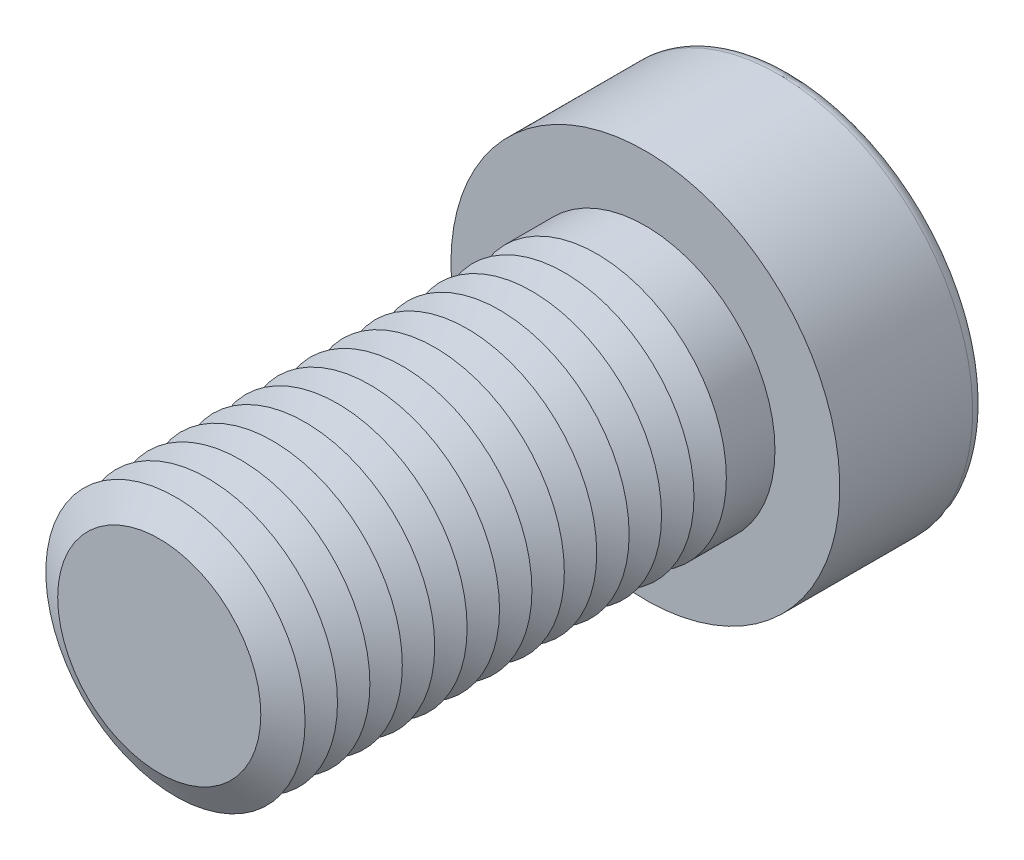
ISO-10303-21;
HEADER;
FILE_DESCRIPTION(('STEP AP214'),'2;1');
FILE_NAME('part.step','',(''),(''),'','','');
FILE_SCHEMA(('AUTOMOTIVE_DESIGN { 1 0 10303 214 1 1 1 1 }'));
ENDSEC;
DATA;
#1=APPLICATION_CONTEXT('core data for automotive mechanical design processes');
#2=APPLICATION_PROTOCOL_DEFINITION('international standard','automotive_design',2000,#1);
#3=PRODUCT_CONTEXT('',#1,'mechanical');
#4=PRODUCT('Part','Part','',(#3));
#5=PRODUCT_RELATED_PRODUCT_CATEGORY('part','',(#4));
#6=PRODUCT_DEFINITION_FORMATION('','',#4);
#7=PRODUCT_DEFINITION_CONTEXT('part definition',#1,'design');
#8=PRODUCT_DEFINITION('design','',#6,#7);
#9=PRODUCT_DEFINITION_SHAPE('','',#8);
#10=(LENGTH_UNIT() NAMED_UNIT(*) SI_UNIT(.MILLI.,.METRE.));
#11=(NAMED_UNIT(*) PLANE_ANGLE_UNIT() SI_UNIT($,.RADIAN.));
#12=(NAMED_UNIT(*) SI_UNIT($,.STERADIAN.) SOLID_ANGLE_UNIT());
#13=UNCERTAINTY_MEASURE_WITH_UNIT(LENGTH_MEASURE(1.E-05),#10,'distance_accuracy_value','');
#14=(GEOMETRIC_REPRESENTATION_CONTEXT(3) GLOBAL_UNCERTAINTY_ASSIGNED_CONTEXT((#13)) GLOBAL_UNIT_ASSIGNED_CONTEXT((#10,
#11,#12)) REPRESENTATION_CONTEXT('',''));
#15=CARTESIAN_POINT('',(0.,0.,0.));
#16=DIRECTION('',(0.,0.,1.));
#17=DIRECTION('',(1.,0.,0.));
#18=AXIS2_PLACEMENT_3D('',#15,#16,#17);
#19=CARTESIAN_POINT('',(0.,0.,23.));
#20=DIRECTION('',(0.,0.,1.));
#21=DIRECTION('',(1.,0.,0.));
#22=AXIS2_PLACEMENT_3D('',#19,#20,#21);
#23=CONICAL_SURFACE('',#22,8.,1.0471975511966);
#24=CARTESIAN_POINT('',(0.,0.,22.));
#25=DIRECTION('',(0.,0.,1.));
#26=DIRECTION('',(1.,0.,0.));
#27=AXIS2_PLACEMENT_3D('',#24,#25,#26);
#28=CIRCLE('',#27,6.26794919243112);
#29=CARTESIAN_POINT('',(6.26794919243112,0.,22.));
#30=VERTEX_POINT('',#29);
#31=EDGE_CURVE('E314',#30,#30,#28,.T.);
#32=ORIENTED_EDGE('',*,*,#31,.T.);
#33=EDGE_LOOP('',(#32));
#34=FACE_BOUND('',#33,.T.);
#35=CARTESIAN_POINT('',(0.,0.,23.));
#36=DIRECTION('',(0.,0.,1.));
#37=DIRECTION('',(1.,0.,0.));
#38=AXIS2_PLACEMENT_3D('',#35,#36,#37);
#39=CIRCLE('',#38,8.);
#40=CARTESIAN_POINT('',(8.,0.,23.));
#41=VERTEX_POINT('',#40);
#42=EDGE_CURVE('E317',#41,#41,#39,.T.);
#43=ORIENTED_EDGE('',*,*,#42,.F.);
#44=EDGE_LOOP('',(#43));
#45=FACE_BOUND('',#44,.T.);
#46=ADVANCED_FACE('F39',(#34,#45),#23,.T.);
#47=CARTESIAN_POINT('',(0.,0.,22.));
#48=DIRECTION('',(0.,0.,-1.));
#49=DIRECTION('',(-1.,0.,0.));
#50=AXIS2_PLACEMENT_3D('',#47,#48,#49);
#51=CONICAL_SURFACE('',#50,6.26794919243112,1.0471975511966);
#52=CARTESIAN_POINT('',(0.,0.,21.));
#53=DIRECTION('',(0.,0.,1.));
#54=DIRECTION('',(1.,0.,0.));
#55=AXIS2_PLACEMENT_3D('',#52,#53,#54);
#56=CIRCLE('',#55,8.);
#57=CARTESIAN_POINT('',(8.,0.,21.));
#58=VERTEX_POINT('',#57);
#59=EDGE_CURVE('E324',#58,#58,#56,.T.);
#60=ORIENTED_EDGE('',*,*,#59,.T.);
#61=EDGE_LOOP('',(#60));
#62=FACE_BOUND('',#61,.T.);
#63=ORIENTED_EDGE('',*,*,#31,.F.);
#64=EDGE_LOOP('',(#63));
#65=FACE_BOUND('',#64,.T.);
#66=ADVANCED_FACE('F245',(#62,#65),#51,.T.);
#67=CARTESIAN_POINT('',(0.,0.,30.));
#68=DIRECTION('',(0.,0.,1.));
#69=DIRECTION('',(1.,0.,0.));
#70=AXIS2_PLACEMENT_3D('',#67,#68,#69);
#71=PLANE('',#70);
#72=CARTESIAN_POINT('',(0.,0.,30.));
#73=DIRECTION('',(0.,0.,1.));
#74=DIRECTION('',(1.,0.,0.));
#75=AXIS2_PLACEMENT_3D('',#72,#73,#74);
#76=CIRCLE('',#75,6.26794919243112);
#77=CARTESIAN_POINT('',(6.26794919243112,0.,30.));
#78=VERTEX_POINT('',#77);
#79=EDGE_CURVE('E174',#78,#78,#76,.T.);
#80=ORIENTED_EDGE('',*,*,#79,.T.);
#81=EDGE_LOOP('',(#80));
#82=FACE_BOUND('',#81,.T.);
#83=ADVANCED_FACE('F251',(#82),#71,.T.);
#84=CARTESIAN_POINT('',(0.,0.,30.));
#85=DIRECTION('',(0.,0.,-1.));
#86=DIRECTION('',(-1.,0.,0.));
#87=AXIS2_PLACEMENT_3D('',#84,#85,#86);
#88=CONICAL_SURFACE('',#87,6.26794919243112,1.0471975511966);
#89=CARTESIAN_POINT('',(0.,0.,29.));
#90=DIRECTION('',(0.,0.,1.));
#91=DIRECTION('',(1.,0.,0.));
#92=AXIS2_PLACEMENT_3D('',#89,#90,#91);
#93=CIRCLE('',#92,8.);
#94=CARTESIAN_POINT('',(8.,0.,29.));
#95=VERTEX_POINT('',#94);
#96=EDGE_CURVE('E291',#95,#95,#93,.T.);
#97=ORIENTED_EDGE('',*,*,#96,.T.);
#98=EDGE_LOOP('',(#97));
#99=FACE_BOUND('',#98,.T.);
#100=ORIENTED_EDGE('',*,*,#79,.F.);
#101=EDGE_LOOP('',(#100));
#102=FACE_BOUND('',#101,.T.);
#103=ADVANCED_FACE('F199',(#99,#102),#88,.T.);
#104=CARTESIAN_POINT('',(0.,0.,29.));
#105=DIRECTION('',(0.,0.,1.));
#106=DIRECTION('',(1.,0.,0.));
#107=AXIS2_PLACEMENT_3D('',#104,#105,#106);
#108=CONICAL_SURFACE('',#107,8.,1.0471975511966);
#109=CARTESIAN_POINT('',(0.,0.,28.));
#110=DIRECTION('',(0.,0.,1.));
#111=DIRECTION('',(1.,0.,0.));
#112=AXIS2_PLACEMENT_3D('',#109,#110,#111);
#113=CIRCLE('',#112,6.26794919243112);
#114=CARTESIAN_POINT('',(6.26794919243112,0.,28.));
#115=VERTEX_POINT('',#114);
#116=EDGE_CURVE('E288',#115,#115,#113,.T.);
#117=ORIENTED_EDGE('',*,*,#116,.T.);
#118=EDGE_LOOP('',(#117));
#119=FACE_BOUND('',#118,.T.);
#120=ORIENTED_EDGE('',*,*,#96,.F.);
#121=EDGE_LOOP('',(#120));
#122=FACE_BOUND('',#121,.T.);
#123=ADVANCED_FACE('F277',(#119,#122),#108,.T.);
#124=CARTESIAN_POINT('',(0.,0.,28.));
#125=DIRECTION('',(0.,0.,-1.));
#126=DIRECTION('',(-1.,0.,0.));
#127=AXIS2_PLACEMENT_3D('',#124,#125,#126);
#128=CONICAL_SURFACE('',#127,6.26794919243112,1.0471975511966);
#129=CARTESIAN_POINT('',(0.,0.,27.));
#130=DIRECTION('',(0.,0.,1.));
#131=DIRECTION('',(1.,0.,0.));
#132=AXIS2_PLACEMENT_3D('',#129,#130,#131);
#133=CIRCLE('',#132,8.);
#134=CARTESIAN_POINT('',(8.,0.,27.));
#135=VERTEX_POINT('',#134);
#136=EDGE_CURVE('E300',#135,#135,#133,.T.);
#137=ORIENTED_EDGE('',*,*,#136,.T.);
#138=EDGE_LOOP('',(#137));
#139=FACE_BOUND('',#138,.T.);
#140=ORIENTED_EDGE('',*,*,#116,.F.);
#141=EDGE_LOOP('',(#140));
#142=FACE_BOUND('',#141,.T.);
#143=ADVANCED_FACE('F274',(#139,#142),#128,.T.);
#144=CARTESIAN_POINT('',(0.,0.,27.));
#145=DIRECTION('',(0.,0.,1.));
#146=DIRECTION('',(1.,0.,0.));
#147=AXIS2_PLACEMENT_3D('',#144,#145,#146);
#148=CONICAL_SURFACE('',#147,8.,1.0471975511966);
#149=CARTESIAN_POINT('',(0.,0.,26.));
#150=DIRECTION('',(0.,0.,1.));
#151=DIRECTION('',(1.,0.,0.));
#152=AXIS2_PLACEMENT_3D('',#149,#150,#151);
#153=CIRCLE('',#152,6.26794919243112);
#154=CARTESIAN_POINT('',(6.26794919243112,0.,26.));
#155=VERTEX_POINT('',#154);
#156=EDGE_CURVE('E293',#155,#155,#153,.T.);
#157=ORIENTED_EDGE('',*,*,#156,.T.);
#158=EDGE_LOOP('',(#157));
#159=FACE_BOUND('',#158,.T.);
#160=ORIENTED_EDGE('',*,*,#136,.F.);
#161=EDGE_LOOP('',(#160));
#162=FACE_BOUND('',#161,.T.);
#163=ADVANCED_FACE('F270',(#159,#162),#148,.T.);
#164=CARTESIAN_POINT('',(0.,0.,26.));
#165=DIRECTION('',(0.,0.,-1.));
#166=DIRECTION('',(-1.,0.,0.));
#167=AXIS2_PLACEMENT_3D('',#164,#165,#166);
#168=CONICAL_SURFACE('',#167,6.26794919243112,1.0471975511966);
#169=CARTESIAN_POINT('',(0.,0.,25.));
#170=DIRECTION('',(0.,0.,1.));
#171=DIRECTION('',(1.,0.,0.));
#172=AXIS2_PLACEMENT_3D('',#169,#170,#171);
#173=CIRCLE('',#172,8.);
#174=CARTESIAN_POINT('',(8.,0.,25.));
#175=VERTEX_POINT('',#174);
#176=EDGE_CURVE('E310',#175,#175,#173,.T.);
#177=ORIENTED_EDGE('',*,*,#176,.T.);
#178=EDGE_LOOP('',(#177));
#179=FACE_BOUND('',#178,.T.);
#180=ORIENTED_EDGE('',*,*,#156,.F.);
#181=EDGE_LOOP('',(#180));
#182=FACE_BOUND('',#181,.T.);
#183=ADVANCED_FACE('F266',(#179,#182),#168,.T.);
#184=CARTESIAN_POINT('',(0.,0.,25.));
#185=DIRECTION('',(0.,0.,1.));
#186=DIRECTION('',(1.,0.,0.));
#187=AXIS2_PLACEMENT_3D('',#184,#185,#186);
#188=CONICAL_SURFACE('',#187,8.,1.0471975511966);
#189=CARTESIAN_POINT('',(0.,0.,24.));
#190=DIRECTION('',(0.,0.,1.));
#191=DIRECTION('',(1.,0.,0.));
#192=AXIS2_PLACEMENT_3D('',#189,#190,#191);
#193=CIRCLE('',#192,6.26794919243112);
#194=CARTESIAN_POINT('',(6.26794919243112,0.,24.));
#195=VERTEX_POINT('',#194);
#196=EDGE_CURVE('E306',#195,#195,#193,.T.);
#197=ORIENTED_EDGE('',*,*,#196,.T.);
#198=EDGE_LOOP('',(#197));
#199=FACE_BOUND('',#198,.T.);
#200=ORIENTED_EDGE('',*,*,#176,.F.);
#201=EDGE_LOOP('',(#200));
#202=FACE_BOUND('',#201,.T.);
#203=ADVANCED_FACE('F262',(#199,#202),#188,.T.);
#204=CARTESIAN_POINT('',(0.,0.,24.));
#205=DIRECTION('',(0.,0.,-1.));
#206=DIRECTION('',(-1.,0.,0.));
#207=AXIS2_PLACEMENT_3D('',#204,#205,#206);
#208=CONICAL_SURFACE('',#207,6.26794919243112,1.0471975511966);
#209=ORIENTED_EDGE('',*,*,#42,.T.);
#210=EDGE_LOOP('',(#209));
#211=FACE_BOUND('',#210,.T.);
#212=ORIENTED_EDGE('',*,*,#196,.F.);
#213=EDGE_LOOP('',(#212));
#214=FACE_BOUND('',#213,.T.);
#215=ADVANCED_FACE('F258',(#211,#214),#208,.T.);
#216=CARTESIAN_POINT('',(0.,0.,21.));
#217=DIRECTION('',(0.,0.,1.));
#218=DIRECTION('',(1.,0.,0.));
#219=AXIS2_PLACEMENT_3D('',#216,#217,#218);
#220=CONICAL_SURFACE('',#219,8.,1.0471975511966);
#221=CARTESIAN_POINT('',(0.,0.,20.));
#222=DIRECTION('',(0.,0.,1.));
#223=DIRECTION('',(1.,0.,0.));
#224=AXIS2_PLACEMENT_3D('',#221,#222,#223);
#225=CIRCLE('',#224,6.26794919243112);
#226=CARTESIAN_POINT('',(6.26794919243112,0.,20.));
#227=VERTEX_POINT('',#226);
#228=EDGE_CURVE('E320',#227,#227,#225,.T.);
#229=ORIENTED_EDGE('',*,*,#228,.T.);
#230=EDGE_LOOP('',(#229));
#231=FACE_BOUND('',#230,.T.);
#232=ORIENTED_EDGE('',*,*,#59,.F.);
#233=EDGE_LOOP('',(#232));
#234=FACE_BOUND('',#233,.T.);
#235=ADVANCED_FACE('F261',(#231,#234),#220,.T.);
#236=CARTESIAN_POINT('',(0.,0.,20.));
#237=DIRECTION('',(0.,0.,-1.));
#238=DIRECTION('',(-1.,0.,0.));
#239=AXIS2_PLACEMENT_3D('',#236,#237,#238);
#240=CONICAL_SURFACE('',#239,6.26794919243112,1.0471975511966);
#241=CARTESIAN_POINT('',(0.,0.,19.));
#242=DIRECTION('',(0.,0.,1.));
#243=DIRECTION('',(1.,0.,0.));
#244=AXIS2_PLACEMENT_3D('',#241,#242,#243);
#245=CIRCLE('',#244,8.);
#246=CARTESIAN_POINT('',(8.,0.,19.));
#247=VERTEX_POINT('',#246);
#248=EDGE_CURVE('E332',#247,#247,#245,.T.);
#249=ORIENTED_EDGE('',*,*,#248,.T.);
#250=EDGE_LOOP('',(#249));
#251=FACE_BOUND('',#250,.T.);
#252=ORIENTED_EDGE('',*,*,#228,.F.);
#253=EDGE_LOOP('',(#252));
#254=FACE_BOUND('',#253,.T.);
#255=ADVANCED_FACE('F464',(#251,#254),#240,.T.);
#256=CARTESIAN_POINT('',(0.,0.,19.));
#257=DIRECTION('',(0.,0.,1.));
#258=DIRECTION('',(1.,0.,0.));
#259=AXIS2_PLACEMENT_3D('',#256,#257,#258);
#260=CONICAL_SURFACE('',#259,8.,1.0471975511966);
#261=CARTESIAN_POINT('',(0.,0.,18.));
#262=DIRECTION('',(0.,0.,1.));
#263=DIRECTION('',(1.,0.,0.));
#264=AXIS2_PLACEMENT_3D('',#261,#262,#263);
#265=CIRCLE('',#264,6.26794919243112);
#266=CARTESIAN_POINT('',(6.26794919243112,0.,18.));
#267=VERTEX_POINT('',#266);
#268=EDGE_CURVE('E328',#267,#267,#265,.T.);
#269=ORIENTED_EDGE('',*,*,#268,.T.);
#270=EDGE_LOOP('',(#269));
#271=FACE_BOUND('',#270,.T.);
#272=ORIENTED_EDGE('',*,*,#248,.F.);
#273=EDGE_LOOP('',(#272));
#274=FACE_BOUND('',#273,.T.);
#275=ADVANCED_FACE('F460',(#271,#274),#260,.T.);
#276=CARTESIAN_POINT('',(0.,0.,18.));
#277=DIRECTION('',(0.,0.,-1.));
#278=DIRECTION('',(-1.,0.,0.));
#279=AXIS2_PLACEMENT_3D('',#276,#277,#278);
#280=CONICAL_SURFACE('',#279,6.26794919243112,1.0471975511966);
#281=CARTESIAN_POINT('',(0.,0.,17.));
#282=DIRECTION('',(0.,0.,1.));
#283=DIRECTION('',(1.,0.,0.));
#284=AXIS2_PLACEMENT_3D('',#281,#282,#283);
#285=CIRCLE('',#284,8.);
#286=CARTESIAN_POINT('',(8.,0.,17.));
#287=VERTEX_POINT('',#286);
#288=EDGE_CURVE('E340',#287,#287,#285,.T.);
#289=ORIENTED_EDGE('',*,*,#288,.T.);
#290=EDGE_LOOP('',(#289));
#291=FACE_BOUND('',#290,.T.);
#292=ORIENTED_EDGE('',*,*,#268,.F.);
#293=EDGE_LOOP('',(#292));
#294=FACE_BOUND('',#293,.T.);
#295=ADVANCED_FACE('F456',(#291,#294),#280,.T.);
#296=CARTESIAN_POINT('',(0.,0.,17.));
#297=DIRECTION('',(0.,0.,1.));
#298=DIRECTION('',(1.,0.,0.));
#299=AXIS2_PLACEMENT_3D('',#296,#297,#298);
#300=CONICAL_SURFACE('',#299,8.,1.0471975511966);
#301=CARTESIAN_POINT('',(0.,0.,16.));
#302=DIRECTION('',(0.,0.,1.));
#303=DIRECTION('',(1.,0.,0.));
#304=AXIS2_PLACEMENT_3D('',#301,#302,#303);
#305=CIRCLE('',#304,6.26794919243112);
#306=CARTESIAN_POINT('',(6.26794919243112,0.,16.));
#307=VERTEX_POINT('',#306);
#308=EDGE_CURVE('E336',#307,#307,#305,.T.);
#309=ORIENTED_EDGE('',*,*,#308,.T.);
#310=EDGE_LOOP('',(#309));
#311=FACE_BOUND('',#310,.T.);
#312=ORIENTED_EDGE('',*,*,#288,.F.);
#313=EDGE_LOOP('',(#312));
#314=FACE_BOUND('',#313,.T.);
#315=ADVANCED_FACE('F452',(#311,#314),#300,.T.);
#316=CARTESIAN_POINT('',(0.,0.,16.));
#317=DIRECTION('',(0.,0.,-1.));
#318=DIRECTION('',(-1.,0.,0.));
#319=AXIS2_PLACEMENT_3D('',#316,#317,#318);
#320=CONICAL_SURFACE('',#319,6.26794919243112,1.0471975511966);
#321=CARTESIAN_POINT('',(0.,0.,15.));
#322=DIRECTION('',(0.,0.,1.));
#323=DIRECTION('',(1.,0.,0.));
#324=AXIS2_PLACEMENT_3D('',#321,#322,#323);
#325=CIRCLE('',#324,8.);
#326=CARTESIAN_POINT('',(8.,0.,15.));
#327=VERTEX_POINT('',#326);
#328=EDGE_CURVE('E348',#327,#327,#325,.T.);
#329=ORIENTED_EDGE('',*,*,#328,.T.);
#330=EDGE_LOOP('',(#329));
#331=FACE_BOUND('',#330,.T.);
#332=ORIENTED_EDGE('',*,*,#308,.F.);
#333=EDGE_LOOP('',(#332));
#334=FACE_BOUND('',#333,.T.);
#335=ADVANCED_FACE('F448',(#331,#334),#320,.T.);
#336=CARTESIAN_POINT('',(0.,0.,15.));
#337=DIRECTION('',(0.,0.,1.));
#338=DIRECTION('',(1.,0.,0.));
#339=AXIS2_PLACEMENT_3D('',#336,#337,#338);
#340=CONICAL_SURFACE('',#339,8.,1.0471975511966);
#341=CARTESIAN_POINT('',(0.,0.,14.));
#342=DIRECTION('',(0.,0.,1.));
#343=DIRECTION('',(1.,0.,0.));
#344=AXIS2_PLACEMENT_3D('',#341,#342,#343);
#345=CIRCLE('',#344,6.26794919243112);
#346=CARTESIAN_POINT('',(6.26794919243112,0.,14.));
#347=VERTEX_POINT('',#346);
#348=EDGE_CURVE('E344',#347,#347,#345,.T.);
#349=ORIENTED_EDGE('',*,*,#348,.T.);
#350=EDGE_LOOP('',(#349));
#351=FACE_BOUND('',#350,.T.);
#352=ORIENTED_EDGE('',*,*,#328,.F.);
#353=EDGE_LOOP('',(#352));
#354=FACE_BOUND('',#353,.T.);
#355=ADVANCED_FACE('F444',(#351,#354),#340,.T.);
#356=CARTESIAN_POINT('',(0.,0.,14.));
#357=DIRECTION('',(0.,0.,-1.));
#358=DIRECTION('',(-1.,0.,0.));
#359=AXIS2_PLACEMENT_3D('',#356,#357,#358);
#360=CONICAL_SURFACE('',#359,6.26794919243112,1.0471975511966);
#361=CARTESIAN_POINT('',(0.,0.,13.));
#362=DIRECTION('',(0.,0.,1.));
#363=DIRECTION('',(1.,0.,0.));
#364=AXIS2_PLACEMENT_3D('',#361,#362,#363);
#365=CIRCLE('',#364,8.);
#366=CARTESIAN_POINT('',(8.,0.,13.));
#367=VERTEX_POINT('',#366);
#368=EDGE_CURVE('E356',#367,#367,#365,.T.);
#369=ORIENTED_EDGE('',*,*,#368,.T.);
#370=EDGE_LOOP('',(#369));
#371=FACE_BOUND('',#370,.T.);
#372=ORIENTED_EDGE('',*,*,#348,.F.);
#373=EDGE_LOOP('',(#372));
#374=FACE_BOUND('',#373,.T.);
#375=ADVANCED_FACE('F440',(#371,#374),#360,.T.);
#376=CARTESIAN_POINT('',(0.,0.,13.));
#377=DIRECTION('',(0.,0.,1.));
#378=DIRECTION('',(1.,0.,0.));
#379=AXIS2_PLACEMENT_3D('',#376,#377,#378);
#380=CONICAL_SURFACE('',#379,8.,1.0471975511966);
#381=CARTESIAN_POINT('',(0.,0.,12.));
#382=DIRECTION('',(0.,0.,1.));
#383=DIRECTION('',(1.,0.,0.));
#384=AXIS2_PLACEMENT_3D('',#381,#382,#383);
#385=CIRCLE('',#384,6.26794919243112);
#386=CARTESIAN_POINT('',(6.26794919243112,0.,12.));
#387=VERTEX_POINT('',#386);
#388=EDGE_CURVE('E352',#387,#387,#385,.T.);
#389=ORIENTED_EDGE('',*,*,#388,.T.);
#390=EDGE_LOOP('',(#389));
#391=FACE_BOUND('',#390,.T.);
#392=ORIENTED_EDGE('',*,*,#368,.F.);
#393=EDGE_LOOP('',(#392));
#394=FACE_BOUND('',#393,.T.);
#395=ADVANCED_FACE('F436',(#391,#394),#380,.T.);
#396=CARTESIAN_POINT('',(0.,0.,12.));
#397=DIRECTION('',(0.,0.,-1.));
#398=DIRECTION('',(-1.,0.,0.));
#399=AXIS2_PLACEMENT_3D('',#396,#397,#398);
#400=CONICAL_SURFACE('',#399,6.26794919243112,1.0471975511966);
#401=CARTESIAN_POINT('',(0.,0.,11.));
#402=DIRECTION('',(0.,0.,1.));
#403=DIRECTION('',(1.,0.,0.));
#404=AXIS2_PLACEMENT_3D('',#401,#402,#403);
#405=CIRCLE('',#404,8.);
#406=CARTESIAN_POINT('',(8.,0.,11.));
#407=VERTEX_POINT('',#406);
#408=EDGE_CURVE('E364',#407,#407,#405,.T.);
#409=ORIENTED_EDGE('',*,*,#408,.T.);
#410=EDGE_LOOP('',(#409));
#411=FACE_BOUND('',#410,.T.);
#412=ORIENTED_EDGE('',*,*,#388,.F.);
#413=EDGE_LOOP('',(#412));
#414=FACE_BOUND('',#413,.T.);
#415=ADVANCED_FACE('F432',(#411,#414),#400,.T.);
#416=CARTESIAN_POINT('',(0.,0.,11.));
#417=DIRECTION('',(0.,0.,1.));
#418=DIRECTION('',(1.,0.,0.));
#419=AXIS2_PLACEMENT_3D('',#416,#417,#418);
#420=CONICAL_SURFACE('',#419,8.,1.0471975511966);
#421=CARTESIAN_POINT('',(0.,0.,10.));
#422=DIRECTION('',(0.,0.,1.));
#423=DIRECTION('',(1.,0.,0.));
#424=AXIS2_PLACEMENT_3D('',#421,#422,#423);
#425=CIRCLE('',#424,6.26794919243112);
#426=CARTESIAN_POINT('',(6.26794919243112,0.,10.));
#427=VERTEX_POINT('',#426);
#428=EDGE_CURVE('E360',#427,#427,#425,.T.);
#429=ORIENTED_EDGE('',*,*,#428,.T.);
#430=EDGE_LOOP('',(#429));
#431=FACE_BOUND('',#430,.T.);
#432=ORIENTED_EDGE('',*,*,#408,.F.);
#433=EDGE_LOOP('',(#432));
#434=FACE_BOUND('',#433,.T.);
#435=ADVANCED_FACE('F428',(#431,#434),#420,.T.);
#436=CARTESIAN_POINT('',(0.,0.,10.));
#437=DIRECTION('',(0.,0.,-1.));
#438=DIRECTION('',(-1.,0.,0.));
#439=AXIS2_PLACEMENT_3D('',#436,#437,#438);
#440=CONICAL_SURFACE('',#439,6.26794919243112,1.0471975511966);
#441=CARTESIAN_POINT('',(0.,0.,9.));
#442=DIRECTION('',(0.,0.,1.));
#443=DIRECTION('',(1.,0.,0.));
#444=AXIS2_PLACEMENT_3D('',#441,#442,#443);
#445=CIRCLE('',#444,8.);
#446=CARTESIAN_POINT('',(8.,0.,9.));
#447=VERTEX_POINT('',#446);
#448=EDGE_CURVE('E372',#447,#447,#445,.T.);
#449=ORIENTED_EDGE('',*,*,#448,.T.);
#450=EDGE_LOOP('',(#449));
#451=FACE_BOUND('',#450,.T.);
#452=ORIENTED_EDGE('',*,*,#428,.F.);
#453=EDGE_LOOP('',(#452));
#454=FACE_BOUND('',#453,.T.);
#455=ADVANCED_FACE('F424',(#451,#454),#440,.T.);
#456=CARTESIAN_POINT('',(0.,0.,9.));
#457=DIRECTION('',(0.,0.,1.));
#458=DIRECTION('',(1.,0.,0.));
#459=AXIS2_PLACEMENT_3D('',#456,#457,#458);
#460=CONICAL_SURFACE('',#459,8.,1.0471975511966);
#461=CARTESIAN_POINT('',(0.,0.,8.));
#462=DIRECTION('',(0.,0.,1.));
#463=DIRECTION('',(1.,0.,0.));
#464=AXIS2_PLACEMENT_3D('',#461,#462,#463);
#465=CIRCLE('',#464,6.26794919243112);
#466=CARTESIAN_POINT('',(6.26794919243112,0.,8.));
#467=VERTEX_POINT('',#466);
#468=EDGE_CURVE('E368',#467,#467,#465,.T.);
#469=ORIENTED_EDGE('',*,*,#468,.T.);
#470=EDGE_LOOP('',(#469));
#471=FACE_BOUND('',#470,.T.);
#472=ORIENTED_EDGE('',*,*,#448,.F.);
#473=EDGE_LOOP('',(#472));
#474=FACE_BOUND('',#473,.T.);
#475=ADVANCED_FACE('F420',(#471,#474),#460,.T.);
#476=CARTESIAN_POINT('',(0.,0.,8.));
#477=DIRECTION('',(0.,0.,-1.));
#478=DIRECTION('',(-1.,0.,0.));
#479=AXIS2_PLACEMENT_3D('',#476,#477,#478);
#480=CONICAL_SURFACE('',#479,6.26794919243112,1.0471975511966);
#481=CARTESIAN_POINT('',(0.,0.,7.));
#482=DIRECTION('',(0.,0.,1.));
#483=DIRECTION('',(1.,0.,0.));
#484=AXIS2_PLACEMENT_3D('',#481,#482,#483);
#485=CIRCLE('',#484,8.);
#486=CARTESIAN_POINT('',(8.,0.,7.));
#487=VERTEX_POINT('',#486);
#488=EDGE_CURVE('E380',#487,#487,#485,.T.);
#489=ORIENTED_EDGE('',*,*,#488,.T.);
#490=EDGE_LOOP('',(#489));
#491=FACE_BOUND('',#490,.T.);
#492=ORIENTED_EDGE('',*,*,#468,.F.);
#493=EDGE_LOOP('',(#492));
#494=FACE_BOUND('',#493,.T.);
#495=ADVANCED_FACE('F416',(#491,#494),#480,.T.);
#496=CARTESIAN_POINT('',(0.,0.,7.));
#497=DIRECTION('',(0.,0.,1.));
#498=DIRECTION('',(1.,0.,0.));
#499=AXIS2_PLACEMENT_3D('',#496,#497,#498);
#500=CONICAL_SURFACE('',#499,8.,1.0471975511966);
#501=CARTESIAN_POINT('',(0.,0.,6.));
#502=DIRECTION('',(0.,0.,1.));
#503=DIRECTION('',(1.,0.,0.));
#504=AXIS2_PLACEMENT_3D('',#501,#502,#503);
#505=CIRCLE('',#504,6.26794919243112);
#506=CARTESIAN_POINT('',(6.26794919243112,0.,6.));
#507=VERTEX_POINT('',#506);
#508=EDGE_CURVE('E376',#507,#507,#505,.T.);
#509=ORIENTED_EDGE('',*,*,#508,.T.);
#510=EDGE_LOOP('',(#509));
#511=FACE_BOUND('',#510,.T.);
#512=ORIENTED_EDGE('',*,*,#488,.F.);
#513=EDGE_LOOP('',(#512));
#514=FACE_BOUND('',#513,.T.);
#515=ADVANCED_FACE('F411',(#511,#514),#500,.T.);
#516=CARTESIAN_POINT('',(0.,0.,6.));
#517=DIRECTION('',(0.,0.,-1.));
#518=DIRECTION('',(-1.,0.,0.));
#519=AXIS2_PLACEMENT_3D('',#516,#517,#518);
#520=CONICAL_SURFACE('',#519,6.26794919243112,1.0471975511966);
#521=CARTESIAN_POINT('',(0.,0.,5.));
#522=DIRECTION('',(0.,0.,1.));
#523=DIRECTION('',(1.,0.,0.));
#524=AXIS2_PLACEMENT_3D('',#521,#522,#523);
#525=CIRCLE('',#524,8.);
#526=CARTESIAN_POINT('',(8.,0.,5.));
#527=VERTEX_POINT('',#526);
#528=EDGE_CURVE('E392',#527,#527,#525,.T.);
#529=ORIENTED_EDGE('',*,*,#528,.T.);
#530=EDGE_LOOP('',(#529));
#531=FACE_BOUND('',#530,.T.);
#532=ORIENTED_EDGE('',*,*,#508,.F.);
#533=EDGE_LOOP('',(#532));
#534=FACE_BOUND('',#533,.T.);
#535=ADVANCED_FACE('F397',(#531,#534),#520,.T.);
#536=CARTESIAN_POINT('',(0.,0.,5.));
#537=DIRECTION('',(0.,0.,1.));
#538=DIRECTION('',(1.,0.,0.));
#539=AXIS2_PLACEMENT_3D('',#536,#537,#538);
#540=CONICAL_SURFACE('',#539,8.,1.0471975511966);
#541=CARTESIAN_POINT('',(0.,0.,4.));
#542=DIRECTION('',(0.,0.,1.));
#543=DIRECTION('',(1.,0.,0.));
#544=AXIS2_PLACEMENT_3D('',#541,#542,#543);
#545=CIRCLE('',#544,6.26794919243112);
#546=CARTESIAN_POINT('',(6.26794919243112,0.,4.));
#547=VERTEX_POINT('',#546);
#548=EDGE_CURVE('E384',#547,#547,#545,.T.);
#549=ORIENTED_EDGE('',*,*,#548,.T.);
#550=EDGE_LOOP('',(#549));
#551=FACE_BOUND('',#550,.T.);
#552=ORIENTED_EDGE('',*,*,#528,.F.);
#553=EDGE_LOOP('',(#552));
#554=FACE_BOUND('',#553,.T.);
#555=ADVANCED_FACE('F400',(#551,#554),#540,.T.);
#556=CARTESIAN_POINT('',(0.,0.,4.));
#557=DIRECTION('',(0.,0.,-1.));
#558=DIRECTION('',(-1.,0.,0.));
#559=AXIS2_PLACEMENT_3D('',#556,#557,#558);
#560=CONICAL_SURFACE('',#559,6.26794919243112,1.0471975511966);
#561=CARTESIAN_POINT('',(0.,0.,3.));
#562=DIRECTION('',(0.,0.,1.));
#563=DIRECTION('',(1.,0.,0.));
#564=AXIS2_PLACEMENT_3D('',#561,#562,#563);
#565=CIRCLE('',#564,8.);
#566=CARTESIAN_POINT('',(8.,0.,3.));
#567=VERTEX_POINT('',#566);
#568=EDGE_CURVE('E388',#567,#567,#565,.T.);
#569=ORIENTED_EDGE('',*,*,#568,.T.);
#570=EDGE_LOOP('',(#569));
#571=FACE_BOUND('',#570,.T.);
#572=ORIENTED_EDGE('',*,*,#548,.F.);
#573=EDGE_LOOP('',(#572));
#574=FACE_BOUND('',#573,.T.);
#575=ADVANCED_FACE('F402',(#571,#574),#560,.T.);
#576=CARTESIAN_POINT('',(0.,0.,0.));
#577=DIRECTION('',(0.,0.,-1.));
#578=DIRECTION('',(-1.,0.,0.));
#579=AXIS2_PLACEMENT_3D('',#576,#577,#578);
#580=CONICAL_SURFACE('',#579,6.,1.0471975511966);
#581=CARTESIAN_POINT('',(0.,0.,3.46410161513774));
#582=VERTEX_POINT('',#581);
#583=VERTEX_LOOP('',#582);
#584=FACE_BOUND('',#583,.T.);
#585=CARTESIAN_POINT('',(0.,0.,0.));
#586=DIRECTION('',(0.,0.,-1.));
#587=DIRECTION('',(-1.,0.,0.));
#588=AXIS2_PLACEMENT_3D('',#585,#586,#587);
#589=CIRCLE('',#588,6.);
#590=CARTESIAN_POINT('',(-5.19615242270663,3.,0.));
#591=VERTEX_POINT('',#590);
#592=CARTESIAN_POINT('',(0.,6.,0.));
#593=VERTEX_POINT('',#592);
#594=EDGE_CURVE('E149',#591,#593,#589,.T.);
#595=ORIENTED_EDGE('',*,*,#594,.T.);
#596=CARTESIAN_POINT('',(0.,0.,0.));
#597=DIRECTION('',(0.,0.,-1.));
#598=DIRECTION('',(-1.,0.,0.));
#599=AXIS2_PLACEMENT_3D('',#596,#597,#598);
#600=CIRCLE('',#599,6.);
#601=CARTESIAN_POINT('',(5.19615242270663,3.,0.));
#602=VERTEX_POINT('',#601);
#603=EDGE_CURVE('E54',#593,#602,#600,.T.);
#604=ORIENTED_EDGE('',*,*,#603,.T.);
#605=CARTESIAN_POINT('',(5.19615242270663,-3.,0.));
#606=VERTEX_POINT('',#605);
#607=EDGE_CURVE('E938',#602,#606,#600,.T.);
#608=ORIENTED_EDGE('',*,*,#607,.T.);
#609=CARTESIAN_POINT('',(0.,-6.,0.));
#610=VERTEX_POINT('',#609);
#611=EDGE_CURVE('E936',#606,#610,#600,.T.);
#612=ORIENTED_EDGE('',*,*,#611,.T.);
#613=CARTESIAN_POINT('',(-5.19615242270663,-3.,0.));
#614=VERTEX_POINT('',#613);
#615=EDGE_CURVE('E930',#610,#614,#600,.T.);
#616=ORIENTED_EDGE('',*,*,#615,.T.);
#617=EDGE_CURVE('E928',#614,#591,#600,.T.);
#618=ORIENTED_EDGE('',*,*,#617,.T.);
#619=EDGE_LOOP('',(#595,#604,#608,#612,#616,#618));
#620=FACE_BOUND('',#619,.T.);
#621=ADVANCED_FACE('F201',(#584,#620),#580,.F.);
#622=CARTESIAN_POINT('',(0.,0.,0.));
#623=DIRECTION('',(0.,0.,-1.));
#624=DIRECTION('',(-1.,0.,0.));
#625=AXIS2_PLACEMENT_3D('',#622,#623,#624);
#626=PLANE('',#625);
#627=ORIENTED_EDGE('',*,*,#603,.F.);
#628=DIRECTION('',(1.,0.,0.));
#629=VECTOR('',#628,1.);
#630=CARTESIAN_POINT('',(-3.46410161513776,6.,0.));
#631=LINE('',#630,#629);
#632=CARTESIAN_POINT('',(3.46410161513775,6.,0.));
#633=VERTEX_POINT('',#632);
#634=EDGE_CURVE('E973',#593,#633,#631,.T.);
#635=ORIENTED_EDGE('',*,*,#634,.T.);
#636=DIRECTION('',(0.5,-0.866025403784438,0.));
#637=VECTOR('',#636,1.);
#638=CARTESIAN_POINT('',(3.46410161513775,6.,0.));
#639=LINE('',#638,#637);
#640=EDGE_CURVE('E155',#633,#602,#639,.T.);
#641=ORIENTED_EDGE('',*,*,#640,.T.);
#642=EDGE_LOOP('',(#627,#635,#641));
#643=FACE_BOUND('',#642,.T.);
#644=ADVANCED_FACE('F541',(#643),#626,.T.);
#645=ORIENTED_EDGE('',*,*,#607,.F.);
#646=CARTESIAN_POINT('',(6.92820323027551,0.,0.));
#647=VERTEX_POINT('',#646);
#648=EDGE_CURVE('E978',#602,#647,#639,.T.);
#649=ORIENTED_EDGE('',*,*,#648,.T.);
#650=DIRECTION('',(-0.5,-0.866025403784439,0.));
#651=VECTOR('',#650,1.);
#652=CARTESIAN_POINT('',(6.92820323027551,0.,0.));
#653=LINE('',#652,#651);
#654=EDGE_CURVE('E950',#647,#606,#653,.T.);
#655=ORIENTED_EDGE('',*,*,#654,.T.);
#656=EDGE_LOOP('',(#645,#649,#655));
#657=FACE_BOUND('',#656,.T.);
#658=ADVANCED_FACE('F551',(#657),#626,.T.);
#659=ORIENTED_EDGE('',*,*,#611,.F.);
#660=CARTESIAN_POINT('',(3.46410161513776,-6.,0.));
#661=VERTEX_POINT('',#660);
#662=EDGE_CURVE('E952',#606,#661,#653,.T.);
#663=ORIENTED_EDGE('',*,*,#662,.T.);
#664=DIRECTION('',(-1.,0.,0.));
#665=VECTOR('',#664,1.);
#666=CARTESIAN_POINT('',(3.46410161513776,-6.,0.));
#667=LINE('',#666,#665);
#668=EDGE_CURVE('E904',#661,#610,#667,.T.);
#669=ORIENTED_EDGE('',*,*,#668,.T.);
#670=EDGE_LOOP('',(#659,#663,#669));
#671=FACE_BOUND('',#670,.T.);
#672=ADVANCED_FACE('F561',(#671),#626,.T.);
#673=ORIENTED_EDGE('',*,*,#615,.F.);
#674=CARTESIAN_POINT('',(-3.46410161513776,-6.,0.));
#675=VERTEX_POINT('',#674);
#676=EDGE_CURVE('E947',#610,#675,#667,.T.);
#677=ORIENTED_EDGE('',*,*,#676,.T.);
#678=DIRECTION('',(-0.5,0.866025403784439,0.));
#679=VECTOR('',#678,1.);
#680=CARTESIAN_POINT('',(-3.46410161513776,-6.,0.));
#681=LINE('',#680,#679);
#682=EDGE_CURVE('E949',#675,#614,#681,.T.);
#683=ORIENTED_EDGE('',*,*,#682,.T.);
#684=EDGE_LOOP('',(#673,#677,#683));
#685=FACE_BOUND('',#684,.T.);
#686=ADVANCED_FACE('F569',(#685),#626,.T.);
#687=ORIENTED_EDGE('',*,*,#617,.F.);
#688=CARTESIAN_POINT('',(-6.92820323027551,0.,0.));
#689=VERTEX_POINT('',#688);
#690=EDGE_CURVE('E954',#614,#689,#681,.T.);
#691=ORIENTED_EDGE('',*,*,#690,.T.);
#692=DIRECTION('',(0.5,0.866025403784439,0.));
#693=VECTOR('',#692,1.);
#694=CARTESIAN_POINT('',(-6.92820323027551,0.,0.));
#695=LINE('',#694,#693);
#696=EDGE_CURVE('E158',#689,#591,#695,.T.);
#697=ORIENTED_EDGE('',*,*,#696,.T.);
#698=EDGE_LOOP('',(#687,#691,#697));
#699=FACE_BOUND('',#698,.T.);
#700=ADVANCED_FACE('F231',(#699),#626,.T.);
#701=ORIENTED_EDGE('',*,*,#594,.F.);
#702=CARTESIAN_POINT('',(-3.46410161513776,6.,0.));
#703=VERTEX_POINT('',#702);
#704=EDGE_CURVE('E960',#591,#703,#695,.T.);
#705=ORIENTED_EDGE('',*,*,#704,.T.);
#706=EDGE_CURVE('E974',#703,#593,#631,.T.);
#707=ORIENTED_EDGE('',*,*,#706,.T.);
#708=EDGE_LOOP('',(#701,#705,#707));
#709=FACE_BOUND('',#708,.T.);
#710=ADVANCED_FACE('F553',(#709),#626,.T.);
#711=CARTESIAN_POINT('',(-3.46410161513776,6.,0.));
#712=DIRECTION('',(0.,1.,0.));
#713=DIRECTION('',(0.,0.,1.));
#714=AXIS2_PLACEMENT_3D('',#711,#712,#713);
#715=PLANE('',#714);
#716=DIRECTION('',(0.,0.,-1.));
#717=VECTOR('',#716,1.);
#718=CARTESIAN_POINT('',(-3.46410161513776,6.,0.));
#719=LINE('',#718,#717);
#720=CARTESIAN_POINT('',(-3.46410161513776,6.,-9.));
#721=VERTEX_POINT('',#720);
#722=EDGE_CURVE('E147',#703,#721,#719,.T.);
#723=ORIENTED_EDGE('',*,*,#722,.T.);
#724=CARTESIAN_POINT('',(-9.04322275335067,6.,-10.0515506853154));
#725=CARTESIAN_POINT('',(-8.77229389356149,6.,-9.99107568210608));
#726=CARTESIAN_POINT('',(-8.50119215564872,6.,-9.93136093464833));
#727=CARTESIAN_POINT('',(-7.95855825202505,6.,-9.81386229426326));
#728=CARTESIAN_POINT('',(-7.68702606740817,6.,-9.75607848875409));
#729=CARTESIAN_POINT('',(-7.14318995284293,6.,-9.64279905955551));
#730=CARTESIAN_POINT('',(-6.87088551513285,6.,-9.58730586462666));
#731=CARTESIAN_POINT('',(-6.32570082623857,6.,-9.47922577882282));
#732=CARTESIAN_POINT('',(-6.05282058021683,6.,-9.42663886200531));
#733=CARTESIAN_POINT('',(-5.50875458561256,6.,-9.32550177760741));
#734=CARTESIAN_POINT('',(-5.23757463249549,6.,-9.27692059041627));
#735=CARTESIAN_POINT('',(-4.69446863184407,6.,-9.18413302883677));
#736=CARTESIAN_POINT('',(-4.42254260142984,6.,-9.13992655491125));
#737=CARTESIAN_POINT('',(-3.87790333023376,6.,-9.05690830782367));
#738=CARTESIAN_POINT('',(-3.6051902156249,6.,-9.0180957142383));
#739=CARTESIAN_POINT('',(-3.05890080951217,6.,-8.94703062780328));
#740=CARTESIAN_POINT('',(-2.7853245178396,6.,-8.91477813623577));
#741=CARTESIAN_POINT('',(-2.23425545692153,6.,-8.85776959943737));
#742=CARTESIAN_POINT('',(-1.95675335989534,6.,-8.83310236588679));
#743=CARTESIAN_POINT('',(-1.40107824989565,6.,-8.79298360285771));
#744=CARTESIAN_POINT('',(-1.12290525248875,6.,-8.77753186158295));
#745=CARTESIAN_POINT('',(-0.566293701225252,6.,-8.75674610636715));
#746=CARTESIAN_POINT('',(-0.28785531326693,6.,-8.75140773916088));
#747=CARTESIAN_POINT('',(0.269026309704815,6.,-8.75117360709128));
#748=CARTESIAN_POINT('',(0.547469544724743,6.,-8.75627785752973));
#749=CARTESIAN_POINT('',(1.10511819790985,6.,-8.77664719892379));
#750=CARTESIAN_POINT('',(1.38432206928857,6.,-8.79195380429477));
#751=CARTESIAN_POINT('',(1.94205759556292,6.,-8.83187108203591));
#752=CARTESIAN_POINT('',(2.22058923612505,6.,-8.85648195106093));
#753=CARTESIAN_POINT('',(2.77698779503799,6.,-8.91379497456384));
#754=CARTESIAN_POINT('',(3.0548541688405,6.,-8.94650233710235));
#755=CARTESIAN_POINT('',(3.60969614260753,6.,-9.01868375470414));
#756=CARTESIAN_POINT('',(3.8866717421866,6.,-9.0581578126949));
#757=CARTESIAN_POINT('',(4.44700464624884,6.,-9.14374886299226));
#758=CARTESIAN_POINT('',(4.73033933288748,6.,-9.190012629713));
#759=CARTESIAN_POINT('',(5.29620685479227,6.,-9.28723184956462));
#760=CARTESIAN_POINT('',(5.57873966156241,6.,-9.3381874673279));
#761=CARTESIAN_POINT('',(6.14313105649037,6.,-9.44386031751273));
#762=CARTESIAN_POINT('',(6.42498956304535,6.,-9.49857798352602));
#763=CARTESIAN_POINT('',(6.98810511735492,6.,-9.61103289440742));
#764=CARTESIAN_POINT('',(7.26936215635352,6.,-9.66877018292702));
#765=CARTESIAN_POINT('',(8.11254995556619,6.,-9.84563705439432));
#766=CARTESIAN_POINT('',(8.67372006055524,6.,-9.96838761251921));
#767=CARTESIAN_POINT('',(9.79457370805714,6.,-10.2202420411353));
#768=CARTESIAN_POINT('',(10.3542573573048,6.,-10.3493454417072));
#769=CARTESIAN_POINT('',(11.4657945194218,6.,-10.6103395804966));
#770=CARTESIAN_POINT('',(12.0176605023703,6.,-10.7421773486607));
#771=CARTESIAN_POINT('',(13.1206665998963,6.,-11.0089002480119));
#772=CARTESIAN_POINT('',(13.6718066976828,6.,-11.1437854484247));
#773=CARTESIAN_POINT('',(14.7727697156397,6.,-11.4155878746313));
#774=CARTESIAN_POINT('',(15.3225934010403,6.,-11.5525020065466));
#775=CARTESIAN_POINT('',(16.4217957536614,6.,-11.8280226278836));
#776=CARTESIAN_POINT('',(16.971174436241,6.,-11.9666290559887));
#777=CARTESIAN_POINT('',(17.5204019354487,6.,-12.1058251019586));
#778=B_SPLINE_CURVE_WITH_KNOTS('',3,(#724,#725,#726,#727,#728,#729,#730,#731,#732,#733,#734,
#735,#736,#737,#738,#739,#740,#741,#742,#743,#744,#745,#746,#747,#748,#749,#750,#751,#752,#753,
#754,#755,#756,#757,#758,#759,#760,#761,#762,#763,#764,#765,#766,#767,#768,#769,#770,#771,#772,
#773,#774,#775,#776,#777),.UNSPECIFIED.,.F.,.F.,(4,2,2,2,2,2,2,2,2,2,2,2,2,2,2,2,2,2,2,2,2,2,2,
2,2,2,4),(0.,0.832792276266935,1.6656222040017,2.49931362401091,3.33299760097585,
4.15946050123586,4.98590459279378,5.81222284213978,6.63854125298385,7.47419540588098,
8.30983035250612,9.14510552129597,9.98038191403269,10.8190780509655,11.6577919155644,
12.4970466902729,13.336301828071,14.1975135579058,15.0587555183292,15.9200969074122,
16.7814507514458,18.5047000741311,20.2278221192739,21.929995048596,23.6322066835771,
25.3320460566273,27.0318240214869),.UNSPECIFIED.);
#779=CARTESIAN_POINT('',(3.46410161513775,6.,-9.));
#780=VERTEX_POINT('',#779);
#781=EDGE_CURVE('E124',#721,#780,#778,.T.);
#782=ORIENTED_EDGE('',*,*,#781,.T.);
#783=DIRECTION('',(0.,0.,-1.));
#784=VECTOR('',#783,1.);
#785=CARTESIAN_POINT('',(3.46410161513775,6.,0.));
#786=LINE('',#785,#784);
#787=EDGE_CURVE('E143',#633,#780,#786,.T.);
#788=ORIENTED_EDGE('',*,*,#787,.F.);
#789=ORIENTED_EDGE('',*,*,#634,.F.);
#790=ORIENTED_EDGE('',*,*,#706,.F.);
#791=EDGE_LOOP('',(#723,#782,#788,#789,#790));
#792=FACE_BOUND('',#791,.T.);
#793=ADVANCED_FACE('F141',(#792),#715,.F.);
#794=CARTESIAN_POINT('',(3.46410161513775,6.,0.));
#795=DIRECTION('',(0.866025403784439,0.5,0.));
#796=DIRECTION('',(-0.5,0.866025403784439,0.));
#797=AXIS2_PLACEMENT_3D('',#794,#795,#796);
#798=PLANE('',#797);
#799=ORIENTED_EDGE('',*,*,#787,.T.);
#800=CARTESIAN_POINT('',(3.46398614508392,6.0002,-9.00003094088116));
#801=CARTESIAN_POINT('',(3.60785114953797,5.75101850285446,-8.96146591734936));
#802=CARTESIAN_POINT('',(3.75197700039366,5.5013852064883,-8.92645521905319));
#803=CARTESIAN_POINT('',(4.0407377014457,5.00123700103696,-8.86494467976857));
#804=CARTESIAN_POINT('',(4.18537273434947,4.75072177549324,-8.83844829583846));
#805=CARTESIAN_POINT('',(4.47427486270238,4.25032861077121,-8.79551324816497));
#806=CARTESIAN_POINT('',(4.61854000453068,4.00045405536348,-8.77902338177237));
#807=CARTESIAN_POINT('',(4.90725426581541,3.5003862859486,-8.75691215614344));
#808=CARTESIAN_POINT('',(5.05170334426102,3.2501931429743,-8.75128869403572));
#809=CARTESIAN_POINT('',(5.34060150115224,2.7498068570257,-8.75128869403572));
#810=CARTESIAN_POINT('',(5.48505057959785,2.49961371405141,-8.75691215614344));
#811=CARTESIAN_POINT('',(5.77376484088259,1.99954594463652,-8.77902338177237));
#812=CARTESIAN_POINT('',(5.91802998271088,1.74967138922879,-8.79551324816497));
#813=CARTESIAN_POINT('',(6.20693211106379,1.24927822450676,-8.83844829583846));
#814=CARTESIAN_POINT('',(6.35156714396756,0.998762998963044,-8.86494467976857));
#815=CARTESIAN_POINT('',(6.6403278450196,0.498614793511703,-8.92645521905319));
#816=CARTESIAN_POINT('',(6.78445369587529,0.248981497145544,-8.96146591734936));
#817=CARTESIAN_POINT('',(6.92831870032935,-0.000199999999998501,-9.00003094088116));
#818=B_SPLINE_CURVE_WITH_KNOTS('',3,(#800,#801,#802,#803,#804,#805,#806,#807,#808,#809,#810,
#811,#812,#813,#814,#815,#816,#817),.UNSPECIFIED.,.F.,.F.,(4,2,2,2,2,2,2,2,4),(0.,
0.870954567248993,1.74226232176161,2.60907321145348,3.47571633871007,4.34235946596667,
5.20917035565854,6.08047811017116,6.95143267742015),.UNSPECIFIED.);
#819=CARTESIAN_POINT('',(6.92820323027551,0.,-9.));
#820=VERTEX_POINT('',#819);
#821=EDGE_CURVE('E11',#780,#820,#818,.T.);
#822=ORIENTED_EDGE('',*,*,#821,.T.);
#823=DIRECTION('',(0.,0.,-1.));
#824=VECTOR('',#823,1.);
#825=CARTESIAN_POINT('',(6.92820323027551,0.,0.));
#826=LINE('',#825,#824);
#827=EDGE_CURVE('E157',#647,#820,#826,.T.);
#828=ORIENTED_EDGE('',*,*,#827,.F.);
#829=ORIENTED_EDGE('',*,*,#648,.F.);
#830=ORIENTED_EDGE('',*,*,#640,.F.);
#831=EDGE_LOOP('',(#799,#822,#828,#829,#830));
#832=FACE_BOUND('',#831,.T.);
#833=ADVANCED_FACE('F152',(#832),#798,.F.);
#834=CARTESIAN_POINT('',(6.92820323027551,0.,0.));
#835=DIRECTION('',(0.866025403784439,-0.5,0.));
#836=DIRECTION('',(0.5,0.866025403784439,0.));
#837=AXIS2_PLACEMENT_3D('',#834,#835,#836);
#838=PLANE('',#837);
#839=ORIENTED_EDGE('',*,*,#827,.T.);
#840=CARTESIAN_POINT('',(6.92831870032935,0.000200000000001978,-9.00003094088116));
#841=CARTESIAN_POINT('',(6.78445369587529,-0.24898149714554,-8.96146591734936));
#842=CARTESIAN_POINT('',(6.6403278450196,-0.498614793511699,-8.92645521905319));
#843=CARTESIAN_POINT('',(6.35156714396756,-0.99876299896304,-8.86494467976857));
#844=CARTESIAN_POINT('',(6.20693211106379,-1.24927822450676,-8.83844829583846));
#845=CARTESIAN_POINT('',(5.91802998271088,-1.74967138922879,-8.79551324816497));
#846=CARTESIAN_POINT('',(5.77376484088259,-1.99954594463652,-8.77902338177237));
#847=CARTESIAN_POINT('',(5.48505057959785,-2.4996137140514,-8.75691215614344));
#848=CARTESIAN_POINT('',(5.34060150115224,-2.7498068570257,-8.75128869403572));
#849=CARTESIAN_POINT('',(5.05170334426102,-3.2501931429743,-8.75128869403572));
#850=CARTESIAN_POINT('',(4.90725426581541,-3.50038628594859,-8.75691215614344));
#851=CARTESIAN_POINT('',(4.61854000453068,-4.00045405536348,-8.77902338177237));
#852=CARTESIAN_POINT('',(4.47427486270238,-4.25032861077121,-8.79551324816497));
#853=CARTESIAN_POINT('',(4.18537273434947,-4.75072177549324,-8.83844829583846));
#854=CARTESIAN_POINT('',(4.04073770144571,-5.00123700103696,-8.86494467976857));
#855=CARTESIAN_POINT('',(3.75197700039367,-5.5013852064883,-8.92645521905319));
#856=CARTESIAN_POINT('',(3.60785114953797,-5.75101850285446,-8.96146591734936));
#857=CARTESIAN_POINT('',(3.46398614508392,-6.0002,-9.00003094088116));
#858=B_SPLINE_CURVE_WITH_KNOTS('',3,(#840,#841,#842,#843,#844,#845,#846,#847,#848,#849,#850,
#851,#852,#853,#854,#855,#856,#857),.UNSPECIFIED.,.F.,.F.,(4,2,2,2,2,2,2,2,4),(0.,
0.870954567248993,1.74226232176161,2.60907321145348,3.47571633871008,4.34235946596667,
5.20917035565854,6.08047811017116,6.95143267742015),.UNSPECIFIED.);
#859=CARTESIAN_POINT('',(3.46410161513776,-6.,-9.));
#860=VERTEX_POINT('',#859);
#861=EDGE_CURVE('E173',#820,#860,#858,.T.);
#862=ORIENTED_EDGE('',*,*,#861,.T.);
#863=DIRECTION('',(0.,0.,-1.));
#864=VECTOR('',#863,1.);
#865=CARTESIAN_POINT('',(3.46410161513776,-6.,0.));
#866=LINE('',#865,#864);
#867=EDGE_CURVE('E899',#661,#860,#866,.T.);
#868=ORIENTED_EDGE('',*,*,#867,.F.);
#869=ORIENTED_EDGE('',*,*,#662,.F.);
#870=ORIENTED_EDGE('',*,*,#654,.F.);
#871=EDGE_LOOP('',(#839,#862,#868,#869,#870));
#872=FACE_BOUND('',#871,.T.);
#873=ADVANCED_FACE('F191',(#872),#838,.F.);
#874=CARTESIAN_POINT('',(3.46410161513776,-6.,0.));
#875=DIRECTION('',(0.,-1.,0.));
#876=DIRECTION('',(0.,0.,-1.));
#877=AXIS2_PLACEMENT_3D('',#874,#875,#876);
#878=PLANE('',#877);
#879=ORIENTED_EDGE('',*,*,#867,.T.);
#880=CARTESIAN_POINT('',(-9.04322275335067,-6.,-10.0515506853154));
#881=CARTESIAN_POINT('',(-8.77229389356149,-6.,-9.99107568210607));
#882=CARTESIAN_POINT('',(-8.50119215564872,-6.,-9.93136093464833));
#883=CARTESIAN_POINT('',(-7.95855825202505,-6.,-9.81386229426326));
#884=CARTESIAN_POINT('',(-7.68702606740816,-6.,-9.75607848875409));
#885=CARTESIAN_POINT('',(-7.14318995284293,-6.,-9.64279905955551));
#886=CARTESIAN_POINT('',(-6.87088551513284,-6.,-9.58730586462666));
#887=CARTESIAN_POINT('',(-6.32570082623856,-6.,-9.47922577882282));
#888=CARTESIAN_POINT('',(-6.05282058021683,-6.,-9.42663886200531));
#889=CARTESIAN_POINT('',(-5.50875458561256,-6.,-9.32550177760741));
#890=CARTESIAN_POINT('',(-5.23757463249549,-6.,-9.27692059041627));
#891=CARTESIAN_POINT('',(-4.69446863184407,-6.,-9.18413302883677));
#892=CARTESIAN_POINT('',(-4.42254260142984,-6.,-9.13992655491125));
#893=CARTESIAN_POINT('',(-3.87790333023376,-6.,-9.05690830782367));
#894=CARTESIAN_POINT('',(-3.6051902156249,-6.,-9.0180957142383));
#895=CARTESIAN_POINT('',(-3.05890080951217,-6.,-8.94703062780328));
#896=CARTESIAN_POINT('',(-2.7853245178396,-6.,-8.91477813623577));
#897=CARTESIAN_POINT('',(-2.23425545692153,-6.,-8.85776959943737));
#898=CARTESIAN_POINT('',(-1.95675335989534,-6.,-8.83310236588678));
#899=CARTESIAN_POINT('',(-1.40107824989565,-6.,-8.79298360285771));
#900=CARTESIAN_POINT('',(-1.12290525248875,-6.,-8.77753186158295));
#901=CARTESIAN_POINT('',(-0.56629370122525,-6.,-8.75674610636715));
#902=CARTESIAN_POINT('',(-0.287855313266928,-6.,-8.75140773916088));
#903=CARTESIAN_POINT('',(0.269026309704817,-6.,-8.75117360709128));
#904=CARTESIAN_POINT('',(0.547469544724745,-6.,-8.75627785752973));
#905=CARTESIAN_POINT('',(1.10511819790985,-6.,-8.77664719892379));
#906=CARTESIAN_POINT('',(1.38432206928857,-6.,-8.79195380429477));
#907=CARTESIAN_POINT('',(1.94205759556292,-6.,-8.83187108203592));
#908=CARTESIAN_POINT('',(2.22058923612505,-6.,-8.85648195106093));
#909=CARTESIAN_POINT('',(2.77698779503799,-6.,-8.91379497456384));
#910=CARTESIAN_POINT('',(3.05485416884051,-6.,-8.94650233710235));
#911=CARTESIAN_POINT('',(3.60969614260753,-6.,-9.01868375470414));
#912=CARTESIAN_POINT('',(3.8866717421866,-6.,-9.0581578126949));
#913=CARTESIAN_POINT('',(4.44700464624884,-6.,-9.14374886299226));
#914=CARTESIAN_POINT('',(4.73033933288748,-6.,-9.190012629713));
#915=CARTESIAN_POINT('',(5.29620685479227,-6.,-9.28723184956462));
#916=CARTESIAN_POINT('',(5.57873966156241,-6.,-9.3381874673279));
#917=CARTESIAN_POINT('',(6.14313105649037,-6.,-9.44386031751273));
#918=CARTESIAN_POINT('',(6.42498956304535,-6.,-9.49857798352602));
#919=CARTESIAN_POINT('',(6.98810511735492,-6.,-9.61103289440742));
#920=CARTESIAN_POINT('',(7.26936215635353,-6.,-9.66877018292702));
#921=CARTESIAN_POINT('',(8.11254995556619,-6.,-9.84563705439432));
#922=CARTESIAN_POINT('',(8.67372006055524,-6.,-9.96838761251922));
#923=CARTESIAN_POINT('',(9.79457370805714,-6.,-10.2202420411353));
#924=CARTESIAN_POINT('',(10.3542573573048,-6.,-10.3493454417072));
#925=CARTESIAN_POINT('',(11.4657945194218,-6.,-10.6103395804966));
#926=CARTESIAN_POINT('',(12.0176605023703,-6.,-10.7421773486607));
#927=CARTESIAN_POINT('',(13.1206665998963,-6.,-11.0089002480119));
#928=CARTESIAN_POINT('',(13.6718066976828,-6.,-11.1437854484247));
#929=CARTESIAN_POINT('',(14.7727697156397,-6.,-11.4155878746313));
#930=CARTESIAN_POINT('',(15.3225934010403,-6.,-11.5525020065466));
#931=CARTESIAN_POINT('',(16.4217957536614,-6.,-11.8280226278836));
#932=CARTESIAN_POINT('',(16.971174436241,-6.,-11.9666290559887));
#933=CARTESIAN_POINT('',(17.5204019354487,-6.,-12.1058251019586));
#934=B_SPLINE_CURVE_WITH_KNOTS('',3,(#880,#881,#882,#883,#884,#885,#886,#887,#888,#889,#890,
#891,#892,#893,#894,#895,#896,#897,#898,#899,#900,#901,#902,#903,#904,#905,#906,#907,#908,#909,
#910,#911,#912,#913,#914,#915,#916,#917,#918,#919,#920,#921,#922,#923,#924,#925,#926,#927,#928,
#929,#930,#931,#932,#933),.UNSPECIFIED.,.F.,.F.,(4,2,2,2,2,2,2,2,2,2,2,2,2,2,2,2,2,2,2,2,2,2,2,
2,2,2,4),(0.,0.832792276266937,1.6656222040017,2.49931362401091,3.33299760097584,
4.15946050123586,4.98590459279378,5.81222284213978,6.63854125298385,7.47419540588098,
8.30983035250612,9.14510552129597,9.98038191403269,10.8190780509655,11.6577919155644,
12.4970466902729,13.336301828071,14.1975135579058,15.0587555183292,15.9200969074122,
16.7814507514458,18.5047000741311,20.2278221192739,21.929995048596,23.6322066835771,
25.3320460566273,27.0318240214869),.UNSPECIFIED.);
#935=CARTESIAN_POINT('',(-3.46410161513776,-6.,-9.));
#936=VERTEX_POINT('',#935);
#937=EDGE_CURVE('E184',#860,#936,#934,.F.);
#938=ORIENTED_EDGE('',*,*,#937,.T.);
#939=DIRECTION('',(0.,0.,-1.));
#940=VECTOR('',#939,1.);
#941=CARTESIAN_POINT('',(-3.46410161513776,-6.,0.));
#942=LINE('',#941,#940);
#943=EDGE_CURVE('E905',#675,#936,#942,.T.);
#944=ORIENTED_EDGE('',*,*,#943,.F.);
#945=ORIENTED_EDGE('',*,*,#676,.F.);
#946=ORIENTED_EDGE('',*,*,#668,.F.);
#947=EDGE_LOOP('',(#879,#938,#944,#945,#946));
#948=FACE_BOUND('',#947,.T.);
#949=ADVANCED_FACE('F234',(#948),#878,.F.);
#950=CARTESIAN_POINT('',(-3.46410161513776,-6.,0.));
#951=DIRECTION('',(-0.866025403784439,-0.5,0.));
#952=DIRECTION('',(0.5,-0.866025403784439,0.));
#953=AXIS2_PLACEMENT_3D('',#950,#951,#952);
#954=PLANE('',#953);
#955=ORIENTED_EDGE('',*,*,#943,.T.);
#956=CARTESIAN_POINT('',(-3.46398614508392,-6.0002,-9.00003094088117));
#957=CARTESIAN_POINT('',(-3.60785114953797,-5.75101850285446,-8.96146591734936));
#958=CARTESIAN_POINT('',(-3.75197700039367,-5.5013852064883,-8.92645521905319));
#959=CARTESIAN_POINT('',(-4.04073770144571,-5.00123700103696,-8.86494467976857));
#960=CARTESIAN_POINT('',(-4.18537273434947,-4.75072177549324,-8.83844829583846));
#961=CARTESIAN_POINT('',(-4.47427486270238,-4.25032861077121,-8.79551324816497));
#962=CARTESIAN_POINT('',(-4.61854000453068,-4.00045405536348,-8.77902338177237));
#963=CARTESIAN_POINT('',(-4.90725426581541,-3.5003862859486,-8.75691215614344));
#964=CARTESIAN_POINT('',(-5.05170334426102,-3.2501931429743,-8.75128869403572));
#965=CARTESIAN_POINT('',(-5.34060150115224,-2.7498068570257,-8.75128869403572));
#966=CARTESIAN_POINT('',(-5.48505057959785,-2.49961371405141,-8.75691215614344));
#967=CARTESIAN_POINT('',(-5.77376484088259,-1.99954594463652,-8.77902338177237));
#968=CARTESIAN_POINT('',(-5.91802998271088,-1.74967138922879,-8.79551324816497));
#969=CARTESIAN_POINT('',(-6.20693211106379,-1.24927822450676,-8.83844829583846));
#970=CARTESIAN_POINT('',(-6.35156714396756,-0.998762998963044,-8.86494467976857));
#971=CARTESIAN_POINT('',(-6.6403278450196,-0.498614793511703,-8.92645521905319));
#972=CARTESIAN_POINT('',(-6.78445369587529,-0.248981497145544,-8.96146591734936));
#973=CARTESIAN_POINT('',(-6.92831870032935,0.000199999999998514,-9.00003094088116));
#974=B_SPLINE_CURVE_WITH_KNOTS('',3,(#956,#957,#958,#959,#960,#961,#962,#963,#964,#965,#966,
#967,#968,#969,#970,#971,#972,#973),.UNSPECIFIED.,.F.,.F.,(4,2,2,2,2,2,2,2,4),(0.,
0.870954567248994,1.74226232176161,2.60907321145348,3.47571633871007,4.34235946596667,
5.20917035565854,6.08047811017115,6.95143267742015),.UNSPECIFIED.);
#975=CARTESIAN_POINT('',(-6.92820323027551,0.,-9.));
#976=VERTEX_POINT('',#975);
#977=EDGE_CURVE('E208',#936,#976,#974,.T.);
#978=ORIENTED_EDGE('',*,*,#977,.T.);
#979=DIRECTION('',(0.,0.,-1.));
#980=VECTOR('',#979,1.);
#981=CARTESIAN_POINT('',(-6.92820323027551,0.,0.));
#982=LINE('',#981,#980);
#983=EDGE_CURVE('E909',#689,#976,#982,.T.);
#984=ORIENTED_EDGE('',*,*,#983,.F.);
#985=ORIENTED_EDGE('',*,*,#690,.F.);
#986=ORIENTED_EDGE('',*,*,#682,.F.);
#987=EDGE_LOOP('',(#955,#978,#984,#985,#986));
#988=FACE_BOUND('',#987,.T.);
#989=ADVANCED_FACE('F229',(#988),#954,.F.);
#990=CARTESIAN_POINT('',(-6.92820323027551,0.,0.));
#991=DIRECTION('',(-0.866025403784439,0.5,0.));
#992=DIRECTION('',(-0.5,-0.866025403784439,0.));
#993=AXIS2_PLACEMENT_3D('',#990,#991,#992);
#994=PLANE('',#993);
#995=ORIENTED_EDGE('',*,*,#983,.T.);
#996=CARTESIAN_POINT('',(-6.92831870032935,-0.000200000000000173,-9.00003094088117));
#997=CARTESIAN_POINT('',(-6.7844536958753,0.248981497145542,-8.96146591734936));
#998=CARTESIAN_POINT('',(-6.6403278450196,0.498614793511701,-8.9264552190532));
#999=CARTESIAN_POINT('',(-6.35156714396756,0.998762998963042,-8.86494467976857));
#1000=CARTESIAN_POINT('',(-6.2069321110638,1.24927822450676,-8.83844829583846));
#1001=CARTESIAN_POINT('',(-5.91802998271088,1.74967138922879,-8.79551324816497));
#1002=CARTESIAN_POINT('',(-5.77376484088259,1.99954594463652,-8.77902338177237));
#1003=CARTESIAN_POINT('',(-5.48505057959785,2.4996137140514,-8.75691215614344));
#1004=CARTESIAN_POINT('',(-5.34060150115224,2.7498068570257,-8.75128869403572));
#1005=CARTESIAN_POINT('',(-5.05170334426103,3.2501931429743,-8.75128869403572));
#1006=CARTESIAN_POINT('',(-4.90725426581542,3.50038628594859,-8.75691215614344));
#1007=CARTESIAN_POINT('',(-4.61854000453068,4.00045405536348,-8.77902338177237));
#1008=CARTESIAN_POINT('',(-4.47427486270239,4.25032861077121,-8.79551324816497));
#1009=CARTESIAN_POINT('',(-4.18537273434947,4.75072177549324,-8.83844829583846));
#1010=CARTESIAN_POINT('',(-4.04073770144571,5.00123700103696,-8.86494467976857));
#1011=CARTESIAN_POINT('',(-3.75197700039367,5.5013852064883,-8.9264552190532));
#1012=CARTESIAN_POINT('',(-3.60785114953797,5.75101850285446,-8.96146591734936));
#1013=CARTESIAN_POINT('',(-3.46398614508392,6.0002,-9.00003094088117));
#1014=B_SPLINE_CURVE_WITH_KNOTS('',3,(#996,#997,#998,#999,#1000,#1001,#1002,#1003,#1004,#1005,
#1006,#1007,#1008,#1009,#1010,#1011,#1012,#1013),.UNSPECIFIED.,.F.,.F.,(4,2,2,2,2,2,2,2,4),(0.,
0.870954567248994,1.74226232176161,2.60907321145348,3.47571633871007,4.34235946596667,
5.20917035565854,6.08047811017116,6.95143267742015),.UNSPECIFIED.);
#1015=EDGE_CURVE('E150',#976,#721,#1014,.T.);
#1016=ORIENTED_EDGE('',*,*,#1015,.T.);
#1017=ORIENTED_EDGE('',*,*,#722,.F.);
#1018=ORIENTED_EDGE('',*,*,#704,.F.);
#1019=ORIENTED_EDGE('',*,*,#696,.F.);
#1020=EDGE_LOOP('',(#995,#1016,#1017,#1018,#1019));
#1021=FACE_BOUND('',#1020,.T.);
#1022=ADVANCED_FACE('F197',(#1021),#994,.F.);
#1023=CARTESIAN_POINT('',(0.,0.,-9.));
#1024=DIRECTION('',(0.,0.,-1.));
#1025=DIRECTION('',(-1.,0.,0.));
#1026=AXIS2_PLACEMENT_3D('',#1023,#1024,#1025);
#1027=CONICAL_SURFACE('',#1026,6.92820323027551,1.30899693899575);
#1028=CARTESIAN_POINT('',(0.,0.,-9.));
#1029=DIRECTION('',(0.,0.,-1.));
#1030=DIRECTION('',(-1.,0.,0.));
#1031=AXIS2_PLACEMENT_3D('',#1028,#1029,#1030);
#1032=CIRCLE('',#1031,6.92820323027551);
#1033=EDGE_CURVE('E120',#721,#780,#1032,.T.);
#1034=ORIENTED_EDGE('',*,*,#1033,.T.);
#1035=ORIENTED_EDGE('',*,*,#781,.F.);
#1036=EDGE_LOOP('',(#1034,#1035));
#1037=FACE_BOUND('',#1036,.T.);
#1038=ADVANCED_FACE('F122',(#1037),#1027,.F.);
#1039=EDGE_CURVE('E129',#780,#820,#1032,.T.);
#1040=ORIENTED_EDGE('',*,*,#1039,.T.);
#1041=ORIENTED_EDGE('',*,*,#821,.F.);
#1042=EDGE_LOOP('',(#1040,#1041));
#1043=FACE_BOUND('',#1042,.T.);
#1044=ADVANCED_FACE('F133',(#1043),#1027,.F.);
#1045=EDGE_CURVE('E164',#820,#860,#1032,.T.);
#1046=ORIENTED_EDGE('',*,*,#1045,.T.);
#1047=ORIENTED_EDGE('',*,*,#861,.F.);
#1048=EDGE_LOOP('',(#1046,#1047));
#1049=FACE_BOUND('',#1048,.T.);
#1050=ADVANCED_FACE('F634',(#1049),#1027,.F.);
#1051=EDGE_CURVE('E169',#860,#936,#1032,.T.);
#1052=ORIENTED_EDGE('',*,*,#1051,.T.);
#1053=ORIENTED_EDGE('',*,*,#937,.F.);
#1054=EDGE_LOOP('',(#1052,#1053));
#1055=FACE_BOUND('',#1054,.T.);
#1056=ADVANCED_FACE('F641',(#1055),#1027,.F.);
#1057=EDGE_CURVE('E67',#936,#976,#1032,.T.);
#1058=ORIENTED_EDGE('',*,*,#1057,.T.);
#1059=ORIENTED_EDGE('',*,*,#977,.F.);
#1060=EDGE_LOOP('',(#1058,#1059));
#1061=FACE_BOUND('',#1060,.T.);
#1062=ADVANCED_FACE('F649',(#1061),#1027,.F.);
#1063=EDGE_CURVE('E60',#976,#721,#1032,.T.);
#1064=ORIENTED_EDGE('',*,*,#1063,.T.);
#1065=ORIENTED_EDGE('',*,*,#1015,.F.);
#1066=EDGE_LOOP('',(#1064,#1065));
#1067=FACE_BOUND('',#1066,.T.);
#1068=ADVANCED_FACE('F198',(#1067),#1027,.F.);
#1069=CARTESIAN_POINT('',(0.,0.,-9.));
#1070=DIRECTION('',(0.,0.,-1.));
#1071=DIRECTION('',(-1.,0.,0.));
#1072=AXIS2_PLACEMENT_3D('',#1069,#1070,#1071);
#1073=PLANE('',#1072);
#1074=ORIENTED_EDGE('',*,*,#1063,.F.);
#1075=ORIENTED_EDGE('',*,*,#1057,.F.);
#1076=ORIENTED_EDGE('',*,*,#1051,.F.);
#1077=ORIENTED_EDGE('',*,*,#1045,.F.);
#1078=ORIENTED_EDGE('',*,*,#1039,.F.);
#1079=ORIENTED_EDGE('',*,*,#1033,.F.);
#1080=EDGE_LOOP('',(#1074,#1075,#1076,#1077,#1078,#1079));
#1081=FACE_BOUND('',#1080,.T.);
#1082=CARTESIAN_POINT('',(0.,0.,-9.));
#1083=DIRECTION('',(0.,0.,-1.));
#1084=DIRECTION('',(-1.,0.,0.));
#1085=AXIS2_PLACEMENT_3D('',#1082,#1083,#1084);
#1086=CIRCLE('',#1085,11.2);
#1087=CARTESIAN_POINT('',(-11.2,0.,-9.));
#1088=VERTEX_POINT('',#1087);
#1089=EDGE_CURVE('E922',#1088,#1088,#1086,.T.);
#1090=ORIENTED_EDGE('',*,*,#1089,.T.);
#1091=EDGE_LOOP('',(#1090));
#1092=FACE_BOUND('',#1091,.T.);
#1093=ADVANCED_FACE('F161',(#1081,#1092),#1073,.T.);
#1094=CARTESIAN_POINT('',(0.,0.,-8.2));
#1095=DIRECTION('',(0.,0.,-1.));
#1096=DIRECTION('',(-1.,0.,0.));
#1097=AXIS2_PLACEMENT_3D('',#1094,#1095,#1096);
#1098=TOROIDAL_SURFACE('',#1097,11.2,0.8);
#1099=CARTESIAN_POINT('',(0.,0.,-8.2));
#1100=DIRECTION('',(0.,0.,-1.));
#1101=DIRECTION('',(-1.,0.,0.));
#1102=AXIS2_PLACEMENT_3D('',#1099,#1100,#1101);
#1103=CIRCLE('',#1102,12.);
#1104=CARTESIAN_POINT('',(-12.,0.,-8.2));
#1105=VERTEX_POINT('',#1104);
#1106=EDGE_CURVE('E926',#1105,#1105,#1103,.F.);
#1107=ORIENTED_EDGE('',*,*,#1106,.F.);
#1108=EDGE_LOOP('',(#1107));
#1109=FACE_BOUND('',#1108,.T.);
#1110=ORIENTED_EDGE('',*,*,#1089,.F.);
#1111=EDGE_LOOP('',(#1110));
#1112=FACE_BOUND('',#1111,.T.);
#1113=ADVANCED_FACE('F41',(#1109,#1112),#1098,.T.);
#1114=CARTESIAN_POINT('',(0.,0.,-9.));
#1115=DIRECTION('',(0.,0.,1.));
#1116=DIRECTION('',(1.,0.,0.));
#1117=AXIS2_PLACEMENT_3D('',#1114,#1115,#1116);
#1118=CYLINDRICAL_SURFACE('',#1117,12.);
#1119=ORIENTED_EDGE('',*,*,#1106,.T.);
#1120=EDGE_LOOP('',(#1119));
#1121=FACE_BOUND('',#1120,.T.);
#1122=CARTESIAN_POINT('',(0.,0.,0.));
#1123=DIRECTION('',(0.,0.,-1.));
#1124=DIRECTION('',(-1.,0.,0.));
#1125=AXIS2_PLACEMENT_3D('',#1122,#1123,#1124);
#1126=CIRCLE('',#1125,12.);
#1127=CARTESIAN_POINT('',(-12.,0.,0.));
#1128=VERTEX_POINT('',#1127);
#1129=EDGE_CURVE('E915',#1128,#1128,#1126,.T.);
#1130=ORIENTED_EDGE('',*,*,#1129,.T.);
#1131=EDGE_LOOP('',(#1130));
#1132=FACE_BOUND('',#1131,.T.);
#1133=ADVANCED_FACE('F673',(#1121,#1132),#1118,.T.);
#1134=CARTESIAN_POINT('',(0.,0.,0.));
#1135=DIRECTION('',(0.,0.,-1.));
#1136=DIRECTION('',(-1.,0.,0.));
#1137=AXIS2_PLACEMENT_3D('',#1134,#1135,#1136);
#1138=PLANE('',#1137);
#1139=CARTESIAN_POINT('',(0.,0.,0.));
#1140=DIRECTION('',(0.,0.,1.));
#1141=DIRECTION('',(1.,0.,0.));
#1142=AXIS2_PLACEMENT_3D('',#1139,#1140,#1141);
#1143=CIRCLE('',#1142,8.);
#1144=CARTESIAN_POINT('',(8.,0.,0.));
#1145=VERTEX_POINT('',#1144);
#1146=EDGE_CURVE('E918',#1145,#1145,#1143,.T.);
#1147=ORIENTED_EDGE('',*,*,#1146,.F.);
#1148=EDGE_LOOP('',(#1147));
#1149=FACE_BOUND('',#1148,.T.);
#1150=ORIENTED_EDGE('',*,*,#1129,.F.);
#1151=EDGE_LOOP('',(#1150));
#1152=FACE_BOUND('',#1151,.T.);
#1153=ADVANCED_FACE('F681',(#1149,#1152),#1138,.F.);
#1154=CARTESIAN_POINT('',(0.,0.,30.));
#1155=DIRECTION('',(0.,0.,-1.));
#1156=DIRECTION('',(-1.,0.,0.));
#1157=AXIS2_PLACEMENT_3D('',#1154,#1155,#1156);
#1158=CYLINDRICAL_SURFACE('',#1157,8.);
#1159=ORIENTED_EDGE('',*,*,#1146,.T.);
#1160=EDGE_LOOP('',(#1159));
#1161=FACE_BOUND('',#1160,.T.);
#1162=ORIENTED_EDGE('',*,*,#568,.F.);
#1163=EDGE_LOOP('',(#1162));
#1164=FACE_BOUND('',#1163,.T.);
#1165=ADVANCED_FACE('F690',(#1161,#1164),#1158,.T.);
#1166=CLOSED_SHELL('',(#46,#66,#83,#103,#123,#143,#163,#183,#203,#215,#235,#255,#275,#295,#315,
#335,#355,#375,#395,#415,#435,#455,#475,#495,#515,#535,#555,#575,#621,#644,#658,#672,#686,#700,
#710,#793,#833,#873,#949,#989,#1022,#1038,#1044,#1050,#1056,#1062,#1068,#1093,#1113,#1133,#1153,#1165));
#1167=MANIFOLD_SOLID_BREP('B2',#1166);
#1168=ADVANCED_BREP_SHAPE_REPRESENTATION('',(#18,#1167),#14);
#1169=SHAPE_DEFINITION_REPRESENTATION(#9,#1168);
ENDSEC;
END-ISO-10303-21;
